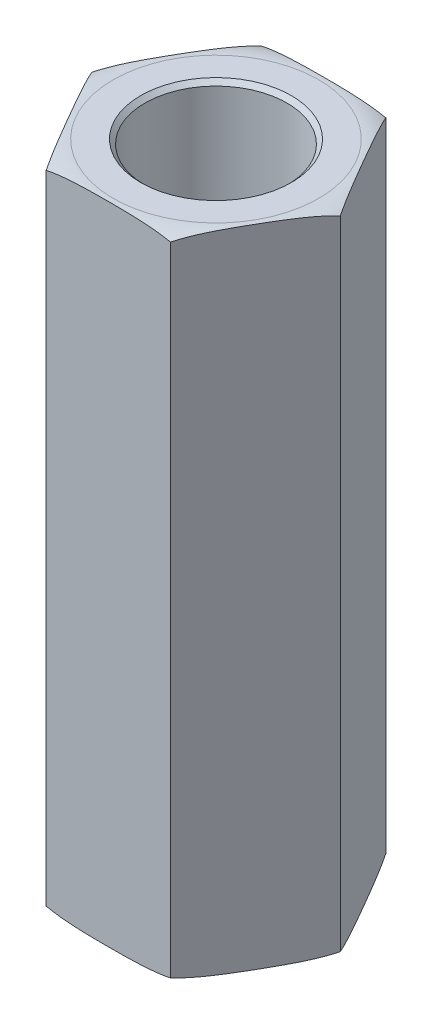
ISO-10303-21;
HEADER;
FILE_DESCRIPTION(('STEP AP214'),'2;1');
FILE_NAME('part.step','',(''),(''),'','','');
FILE_SCHEMA(('AUTOMOTIVE_DESIGN { 1 0 10303 214 1 1 1 1 }'));
ENDSEC;
DATA;
#1=APPLICATION_CONTEXT('core data for automotive mechanical design processes');
#2=APPLICATION_PROTOCOL_DEFINITION('international standard','automotive_design',2000,#1);
#3=PRODUCT_CONTEXT('',#1,'mechanical');
#4=PRODUCT('Part','Part','',(#3));
#5=PRODUCT_RELATED_PRODUCT_CATEGORY('part','',(#4));
#6=PRODUCT_DEFINITION_FORMATION('','',#4);
#7=PRODUCT_DEFINITION_CONTEXT('part definition',#1,'design');
#8=PRODUCT_DEFINITION('design','',#6,#7);
#9=PRODUCT_DEFINITION_SHAPE('','',#8);
#10=(LENGTH_UNIT() NAMED_UNIT(*) SI_UNIT(.MILLI.,.METRE.));
#11=(NAMED_UNIT(*) PLANE_ANGLE_UNIT() SI_UNIT($,.RADIAN.));
#12=(NAMED_UNIT(*) SI_UNIT($,.STERADIAN.) SOLID_ANGLE_UNIT());
#13=UNCERTAINTY_MEASURE_WITH_UNIT(LENGTH_MEASURE(1.E-05),#10,'distance_accuracy_value','');
#14=(GEOMETRIC_REPRESENTATION_CONTEXT(3) GLOBAL_UNCERTAINTY_ASSIGNED_CONTEXT((#13)) GLOBAL_UNIT_ASSIGNED_CONTEXT((#10,
#11,#12)) REPRESENTATION_CONTEXT('',''));
#15=CARTESIAN_POINT('',(0.,0.,0.));
#16=DIRECTION('',(0.,0.,1.));
#17=DIRECTION('',(1.,0.,0.));
#18=AXIS2_PLACEMENT_3D('',#15,#16,#17);
#19=CARTESIAN_POINT('',(3.66617420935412,9.525,0.));
#20=DIRECTION('',(-0.866025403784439,0.,0.5));
#21=DIRECTION('',(0.5,0.,0.866025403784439));
#22=AXIS2_PLACEMENT_3D('',#19,#20,#21);
#23=PLANE('',#22);
#24=CARTESIAN_POINT('',(3.66617420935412,9.398,0.));
#25=CARTESIAN_POINT('',(3.63753042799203,9.40993202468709,-0.0496124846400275));
#26=CARTESIAN_POINT('',(3.60875945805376,9.42055614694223,-0.0994452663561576));
#27=CARTESIAN_POINT('',(3.5510445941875,9.43952869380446,-0.199410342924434));
#28=CARTESIAN_POINT('',(3.52210079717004,9.44787829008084,-0.249542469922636));
#29=CARTESIAN_POINT('',(3.43520914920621,9.47001015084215,-0.400043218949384));
#30=CARTESIAN_POINT('',(3.37708055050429,9.48092253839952,-0.500724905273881));
#31=CARTESIAN_POINT('',(3.26070078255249,9.4975474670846,-0.702300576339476));
#32=CARTESIAN_POINT('',(3.20244972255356,9.50326351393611,-0.803194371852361));
#33=CARTESIAN_POINT('',(3.08586365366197,9.51154325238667,-1.00512736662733));
#34=CARTESIAN_POINT('',(3.02752861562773,9.5141051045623,-1.1061666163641));
#35=CARTESIAN_POINT('',(2.91138213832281,9.5174800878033,-1.30733821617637));
#36=CARTESIAN_POINT('',(2.85357078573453,9.51830898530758,-1.40747041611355));
#37=CARTESIAN_POINT('',(2.73795502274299,9.51890235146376,-1.60772279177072));
#38=CARTESIAN_POINT('',(2.68015061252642,9.51866697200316,-1.70784296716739));
#39=CARTESIAN_POINT('',(2.56452713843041,9.51693398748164,-1.9081086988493));
#40=CARTESIAN_POINT('',(2.50670807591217,9.51543597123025,-2.00825425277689));
#41=CARTESIAN_POINT('',(2.39109525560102,9.51017531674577,-2.20850153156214));
#42=CARTESIAN_POINT('',(2.33330149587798,9.50641290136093,-2.30860325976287));
#43=CARTESIAN_POINT('',(2.23849359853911,9.49698899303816,-2.47281535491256));
#44=CARTESIAN_POINT('',(2.20145192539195,9.49249057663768,-2.5369734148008));
#45=CARTESIAN_POINT('',(2.12747060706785,9.48130148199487,-2.66511281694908));
#46=CARTESIAN_POINT('',(2.09053091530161,9.47461207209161,-2.72909423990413));
#47=CARTESIAN_POINT('',(2.01669860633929,9.45839780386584,-2.85697555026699));
#48=CARTESIAN_POINT('',(1.97980639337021,9.44886525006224,-2.92087473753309));
#49=CARTESIAN_POINT('',(1.90623831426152,9.42626291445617,-3.04829838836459));
#50=CARTESIAN_POINT('',(1.86956287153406,9.41318767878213,-3.11182211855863));
#51=CARTESIAN_POINT('',(1.83308710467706,9.398,-3.175));
#52=B_SPLINE_CURVE_WITH_KNOTS('',3,(#24,#25,#26,#27,#28,#29,#30,#31,#32,#33,#34,#35,#36,#37,#38,
#39,#40,#41,#42,#43,#44,#45,#46,#47,#48,#49,#50,#51),.UNSPECIFIED.,.F.,.F.,(4,2,2,2,2,2,2,2,2,2,
2,2,2,4),(0.,0.17550946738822,0.350928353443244,0.701031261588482,1.05089779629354,
1.40096826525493,1.74783967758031,2.09466158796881,2.44159648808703,2.78849725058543,
3.0111319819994,3.23363806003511,3.45675194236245,3.68021127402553),.UNSPECIFIED.);
#53=CARTESIAN_POINT('',(3.66617420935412,9.398,0.));
#54=VERTEX_POINT('',#53);
#55=CARTESIAN_POINT('',(1.83308710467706,9.398,-3.175));
#56=VERTEX_POINT('',#55);
#57=EDGE_CURVE('E107',#54,#56,#52,.T.);
#58=ORIENTED_EDGE('',*,*,#57,.F.);
#59=DIRECTION('',(0.,1.,0.));
#60=VECTOR('',#59,1.);
#61=CARTESIAN_POINT('',(3.66617420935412,9.525,0.));
#62=LINE('',#61,#60);
#63=CARTESIAN_POINT('',(3.66617420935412,-9.398,0.));
#64=VERTEX_POINT('',#63);
#65=EDGE_CURVE('E80',#54,#64,#62,.F.);
#66=ORIENTED_EDGE('',*,*,#65,.T.);
#67=CARTESIAN_POINT('',(1.83308710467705,-9.398,-3.17500000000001));
#68=CARTESIAN_POINT('',(1.86173088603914,-9.40993202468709,-3.12538751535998));
#69=CARTESIAN_POINT('',(1.89050185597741,-9.42055614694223,-3.07555473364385));
#70=CARTESIAN_POINT('',(1.94821671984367,-9.43952869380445,-2.97558965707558));
#71=CARTESIAN_POINT('',(1.97716051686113,-9.44787829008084,-2.92545753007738));
#72=CARTESIAN_POINT('',(2.06405216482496,-9.47001015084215,-2.77495678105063));
#73=CARTESIAN_POINT('',(2.12218076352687,-9.48092253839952,-2.67427509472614));
#74=CARTESIAN_POINT('',(2.23856053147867,-9.4975474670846,-2.47269942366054));
#75=CARTESIAN_POINT('',(2.2968115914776,-9.50326351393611,-2.37180562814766));
#76=CARTESIAN_POINT('',(2.41339766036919,-9.51154325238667,-2.1698726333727));
#77=CARTESIAN_POINT('',(2.47173269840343,-9.5141051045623,-2.06883338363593));
#78=CARTESIAN_POINT('',(2.58787917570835,-9.5174800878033,-1.86766178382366));
#79=CARTESIAN_POINT('',(2.64569052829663,-9.51830898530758,-1.76752958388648));
#80=CARTESIAN_POINT('',(2.76130629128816,-9.51890235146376,-1.56727720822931));
#81=CARTESIAN_POINT('',(2.81911070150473,-9.51866697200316,-1.46715703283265));
#82=CARTESIAN_POINT('',(2.93473417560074,-9.51693398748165,-1.26689130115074));
#83=CARTESIAN_POINT('',(2.99255323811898,-9.51543597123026,-1.16674574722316));
#84=CARTESIAN_POINT('',(3.10816605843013,-9.51017531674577,-0.966498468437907));
#85=CARTESIAN_POINT('',(3.16595981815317,-9.50641290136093,-0.866396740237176));
#86=CARTESIAN_POINT('',(3.26076771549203,-9.49698899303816,-0.702184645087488));
#87=CARTESIAN_POINT('',(3.2978093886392,-9.49249057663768,-0.63802658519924));
#88=CARTESIAN_POINT('',(3.37179070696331,-9.48130148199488,-0.509887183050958));
#89=CARTESIAN_POINT('',(3.40873039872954,-9.47461207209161,-0.445905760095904));
#90=CARTESIAN_POINT('',(3.48256270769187,-9.45839780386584,-0.318024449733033));
#91=CARTESIAN_POINT('',(3.51945492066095,-9.44886525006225,-0.254125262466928));
#92=CARTESIAN_POINT('',(3.59302299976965,-9.42626291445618,-0.126701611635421));
#93=CARTESIAN_POINT('',(3.62969844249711,-9.41318767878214,-0.0631778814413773));
#94=CARTESIAN_POINT('',(3.66617420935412,-9.398,0.));
#95=B_SPLINE_CURVE_WITH_KNOTS('',3,(#67,#68,#69,#70,#71,#72,#73,#74,#75,#76,#77,#78,#79,#80,#81,
#82,#83,#84,#85,#86,#87,#88,#89,#90,#91,#92,#93,#94),.UNSPECIFIED.,.F.,.F.,(4,2,2,2,2,2,2,2,2,2,
2,2,2,4),(0.,0.175509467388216,0.350928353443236,0.701031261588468,1.05089779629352,
1.4009682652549,1.74783967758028,2.09466158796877,2.44159648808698,2.78849725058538,
3.01113198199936,3.23363806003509,3.45675194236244,3.68021127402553),.UNSPECIFIED.);
#96=CARTESIAN_POINT('',(1.83308710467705,-9.398,-3.175));
#97=VERTEX_POINT('',#96);
#98=EDGE_CURVE('E97',#97,#64,#95,.T.);
#99=ORIENTED_EDGE('',*,*,#98,.F.);
#100=DIRECTION('',(0.,1.,0.));
#101=VECTOR('',#100,1.);
#102=CARTESIAN_POINT('',(1.83308710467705,9.525,-3.175));
#103=LINE('',#102,#101);
#104=EDGE_CURVE('E111',#97,#56,#103,.T.);
#105=ORIENTED_EDGE('',*,*,#104,.T.);
#106=EDGE_LOOP('',(#58,#66,#99,#105));
#107=FACE_BOUND('',#106,.T.);
#108=ADVANCED_FACE('F17',(#107),#23,.F.);
#109=CARTESIAN_POINT('',(1.83308710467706,9.525,3.17499999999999));
#110=DIRECTION('',(-0.866025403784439,0.,-0.5));
#111=DIRECTION('',(-0.5,0.,0.866025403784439));
#112=AXIS2_PLACEMENT_3D('',#109,#110,#111);
#113=PLANE('',#112);
#114=CARTESIAN_POINT('',(1.83308710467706,9.398,3.17499999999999));
#115=CARTESIAN_POINT('',(1.86173088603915,9.40993202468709,3.12538751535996));
#116=CARTESIAN_POINT('',(1.89050185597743,9.42055614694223,3.07555473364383));
#117=CARTESIAN_POINT('',(1.94821671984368,9.43952869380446,2.97558965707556));
#118=CARTESIAN_POINT('',(1.97716051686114,9.44787829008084,2.92545753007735));
#119=CARTESIAN_POINT('',(2.06405216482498,9.47001015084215,2.77495678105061));
#120=CARTESIAN_POINT('',(2.12218076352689,9.48092253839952,2.67427509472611));
#121=CARTESIAN_POINT('',(2.23856053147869,9.4975474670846,2.47269942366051));
#122=CARTESIAN_POINT('',(2.29681159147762,9.50326351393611,2.37180562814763));
#123=CARTESIAN_POINT('',(2.41339766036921,9.51154325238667,2.16987263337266));
#124=CARTESIAN_POINT('',(2.47173269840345,9.5141051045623,2.06883338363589));
#125=CARTESIAN_POINT('',(2.58787917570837,9.5174800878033,1.86766178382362));
#126=CARTESIAN_POINT('',(2.64569052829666,9.51830898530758,1.76752958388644));
#127=CARTESIAN_POINT('',(2.76130629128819,9.51890235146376,1.56727720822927));
#128=CARTESIAN_POINT('',(2.81911070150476,9.51866697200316,1.4671570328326));
#129=CARTESIAN_POINT('',(2.93473417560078,9.51693398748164,1.26689130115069));
#130=CARTESIAN_POINT('',(2.99255323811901,9.51543597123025,1.1667457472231));
#131=CARTESIAN_POINT('',(3.10816605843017,9.51017531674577,0.966498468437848));
#132=CARTESIAN_POINT('',(3.16595981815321,9.50641290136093,0.866396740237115));
#133=CARTESIAN_POINT('',(3.26076771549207,9.49698899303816,0.702184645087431));
#134=CARTESIAN_POINT('',(3.29780938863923,9.49249057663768,0.638026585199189));
#135=CARTESIAN_POINT('',(3.37179070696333,9.48130148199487,0.509887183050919));
#136=CARTESIAN_POINT('',(3.40873039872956,9.47461207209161,0.44590576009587));
#137=CARTESIAN_POINT('',(3.48256270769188,9.45839780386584,0.31802444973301));
#138=CARTESIAN_POINT('',(3.51945492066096,9.44886525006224,0.254125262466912));
#139=CARTESIAN_POINT('',(3.59302299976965,9.42626291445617,0.126701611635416));
#140=CARTESIAN_POINT('',(3.62969844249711,9.41318767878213,0.0631778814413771));
#141=CARTESIAN_POINT('',(3.66617420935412,9.398,0.));
#142=B_SPLINE_CURVE_WITH_KNOTS('',3,(#114,#115,#116,#117,#118,#119,#120,#121,#122,#123,#124,
#125,#126,#127,#128,#129,#130,#131,#132,#133,#134,#135,#136,#137,#138,#139,#140,#141),
.UNSPECIFIED.,.F.,.F.,(4,2,2,2,2,2,2,2,2,2,2,2,2,4),(0.,0.17550946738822,0.350928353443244,
0.701031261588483,1.05089779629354,1.40096826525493,1.74783967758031,2.09466158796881,
2.44159648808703,2.78849725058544,3.01113198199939,3.2336380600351,3.45675194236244,
3.68021127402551),.UNSPECIFIED.);
#143=CARTESIAN_POINT('',(1.83308710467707,9.398,3.17499999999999));
#144=VERTEX_POINT('',#143);
#145=EDGE_CURVE('E22',#144,#54,#142,.T.);
#146=ORIENTED_EDGE('',*,*,#145,.F.);
#147=DIRECTION('',(0.,1.,0.));
#148=VECTOR('',#147,1.);
#149=CARTESIAN_POINT('',(1.83308710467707,9.525,3.17499999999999));
#150=LINE('',#149,#148);
#151=CARTESIAN_POINT('',(1.83308710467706,-9.398,3.17499999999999));
#152=VERTEX_POINT('',#151);
#153=EDGE_CURVE('E100',#144,#152,#150,.F.);
#154=ORIENTED_EDGE('',*,*,#153,.T.);
#155=CARTESIAN_POINT('',(3.66617420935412,-9.398,0.));
#156=CARTESIAN_POINT('',(3.63753042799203,-9.40993202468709,0.0496124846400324));
#157=CARTESIAN_POINT('',(3.60875945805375,-9.42055614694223,0.0994452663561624));
#158=CARTESIAN_POINT('',(3.5510445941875,-9.43952869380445,0.199410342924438));
#159=CARTESIAN_POINT('',(3.52210079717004,-9.44787829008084,0.24954246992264));
#160=CARTESIAN_POINT('',(3.43520914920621,-9.47001015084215,0.400043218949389));
#161=CARTESIAN_POINT('',(3.37708055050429,-9.48092253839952,0.500724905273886));
#162=CARTESIAN_POINT('',(3.26070078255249,-9.4975474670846,0.702300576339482));
#163=CARTESIAN_POINT('',(3.20244972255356,-9.50326351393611,0.803194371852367));
#164=CARTESIAN_POINT('',(3.08586365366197,-9.51154325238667,1.00512736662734));
#165=CARTESIAN_POINT('',(3.02752861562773,-9.5141051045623,1.1061666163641));
#166=CARTESIAN_POINT('',(2.91138213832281,-9.5174800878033,1.30733821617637));
#167=CARTESIAN_POINT('',(2.85357078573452,-9.51830898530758,1.40747041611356));
#168=CARTESIAN_POINT('',(2.73795502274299,-9.51890235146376,1.60772279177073));
#169=CARTESIAN_POINT('',(2.68015061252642,-9.51866697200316,1.70784296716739));
#170=CARTESIAN_POINT('',(2.5645271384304,-9.51693398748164,1.90810869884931));
#171=CARTESIAN_POINT('',(2.50670807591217,-9.51543597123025,2.00825425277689));
#172=CARTESIAN_POINT('',(2.39109525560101,-9.51017531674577,2.20850153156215));
#173=CARTESIAN_POINT('',(2.33330149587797,-9.50641290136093,2.30860325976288));
#174=CARTESIAN_POINT('',(2.23849359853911,-9.49698899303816,2.47281535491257));
#175=CARTESIAN_POINT('',(2.20145192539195,-9.49249057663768,2.53697341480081));
#176=CARTESIAN_POINT('',(2.12747060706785,-9.48130148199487,2.66511281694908));
#177=CARTESIAN_POINT('',(2.09053091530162,-9.47461207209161,2.72909423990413));
#178=CARTESIAN_POINT('',(2.0166986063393,-9.45839780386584,2.85697555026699));
#179=CARTESIAN_POINT('',(1.97980639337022,-9.44886525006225,2.92087473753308));
#180=CARTESIAN_POINT('',(1.90623831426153,-9.42626291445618,3.04829838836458));
#181=CARTESIAN_POINT('',(1.86956287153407,-9.41318767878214,3.11182211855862));
#182=CARTESIAN_POINT('',(1.83308710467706,-9.398,3.17499999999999));
#183=B_SPLINE_CURVE_WITH_KNOTS('',3,(#155,#156,#157,#158,#159,#160,#161,#162,#163,#164,#165,
#166,#167,#168,#169,#170,#171,#172,#173,#174,#175,#176,#177,#178,#179,#180,#181,#182),
.UNSPECIFIED.,.F.,.F.,(4,2,2,2,2,2,2,2,2,2,2,2,2,4),(0.,0.175509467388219,0.350928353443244,
0.701031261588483,1.05089779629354,1.40096826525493,1.74783967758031,2.09466158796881,
2.44159648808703,2.78849725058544,3.01113198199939,3.2336380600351,3.45675194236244,
3.68021127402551),.UNSPECIFIED.);
#184=EDGE_CURVE('E205',#64,#152,#183,.T.);
#185=ORIENTED_EDGE('',*,*,#184,.F.);
#186=ORIENTED_EDGE('',*,*,#65,.F.);
#187=EDGE_LOOP('',(#146,#154,#185,#186));
#188=FACE_BOUND('',#187,.T.);
#189=ADVANCED_FACE('F106',(#188),#113,.F.);
#190=CARTESIAN_POINT('',(-1.83308710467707,9.525,3.175));
#191=DIRECTION('',(0.,0.,-1.));
#192=DIRECTION('',(-1.,0.,0.));
#193=AXIS2_PLACEMENT_3D('',#190,#191,#192);
#194=PLANE('',#193);
#195=ORIENTED_EDGE('',*,*,#153,.F.);
#196=CARTESIAN_POINT('',(-1.83308710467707,9.39799999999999,3.175));
#197=CARTESIAN_POINT('',(-1.75760871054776,9.41371230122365,3.175));
#198=CARTESIAN_POINT('',(-1.68170571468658,9.4271647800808,3.175));
#199=CARTESIAN_POINT('',(-1.52939807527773,9.45030486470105,3.175));
#200=CARTESIAN_POINT('',(-1.45299400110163,9.45999617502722,3.175));
#201=CARTESIAN_POINT('',(-1.30011823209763,9.47637135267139,3.175));
#202=CARTESIAN_POINT('',(-1.22364747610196,9.48306442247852,3.175));
#203=CARTESIAN_POINT('',(-1.07052459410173,9.49417241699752,3.175));
#204=CARTESIAN_POINT('',(-0.993872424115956,9.49858671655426,3.175));
#205=CARTESIAN_POINT('',(-0.840856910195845,9.50572419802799,3.175));
#206=CARTESIAN_POINT('',(-0.764493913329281,9.50845527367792,3.175));
#207=CARTESIAN_POINT('',(-0.611734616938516,9.51275632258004,3.175));
#208=CARTESIAN_POINT('',(-0.535338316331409,9.51432625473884,3.175));
#209=CARTESIAN_POINT('',(-0.38245423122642,9.51668247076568,3.175));
#210=CARTESIAN_POINT('',(-0.305966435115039,9.51746792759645,3.175));
#211=CARTESIAN_POINT('',(-0.152985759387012,9.51848841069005,3.175));
#212=CARTESIAN_POINT('',(-0.076492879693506,9.51872342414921,3.175));
#213=CARTESIAN_POINT('',(0.0764928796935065,9.51872342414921,3.175));
#214=CARTESIAN_POINT('',(0.152985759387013,9.51848841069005,3.17499999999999));
#215=CARTESIAN_POINT('',(0.305966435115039,9.51746792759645,3.17499999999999));
#216=CARTESIAN_POINT('',(0.38245423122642,9.51668247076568,3.17499999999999));
#217=CARTESIAN_POINT('',(0.535338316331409,9.51432625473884,3.17499999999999));
#218=CARTESIAN_POINT('',(0.611734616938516,9.51275632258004,3.17499999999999));
#219=CARTESIAN_POINT('',(0.764493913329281,9.50845527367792,3.17499999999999));
#220=CARTESIAN_POINT('',(0.840856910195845,9.50572419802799,3.17499999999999));
#221=CARTESIAN_POINT('',(0.993872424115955,9.49858671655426,3.17499999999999));
#222=CARTESIAN_POINT('',(1.07052459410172,9.49417241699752,3.17499999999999));
#223=CARTESIAN_POINT('',(1.22364747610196,9.48306442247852,3.17499999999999));
#224=CARTESIAN_POINT('',(1.30011823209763,9.47637135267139,3.17499999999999));
#225=CARTESIAN_POINT('',(1.45299400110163,9.45999617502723,3.17499999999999));
#226=CARTESIAN_POINT('',(1.52939807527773,9.45030486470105,3.17499999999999));
#227=CARTESIAN_POINT('',(1.68170571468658,9.42716478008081,3.17499999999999));
#228=CARTESIAN_POINT('',(1.75760871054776,9.41371230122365,3.17499999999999));
#229=CARTESIAN_POINT('',(1.83308710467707,9.398,3.17499999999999));
#230=B_SPLINE_CURVE_WITH_KNOTS('',3,(#196,#197,#198,#199,#200,#201,#202,#203,#204,#205,#206,
#207,#208,#209,#210,#211,#212,#213,#214,#215,#216,#217,#218,#219,#220,#221,#222,#223,#224,#225,
#226,#227,#228,#229),.UNSPECIFIED.,.F.,.F.,(4,2,2,2,2,2,2,2,2,2,2,2,2,2,2,2,4),(0.,
0.23119079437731,0.46215329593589,0.692401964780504,0.922713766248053,1.15193709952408,
1.3811685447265,1.61064140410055,1.84011960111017,2.06959779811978,2.29907065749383,
2.52830210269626,2.75752543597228,2.98783723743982,3.21808590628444,3.44904840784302,
3.68023920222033),.UNSPECIFIED.);
#231=CARTESIAN_POINT('',(-1.83308710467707,9.398,3.175));
#232=VERTEX_POINT('',#231);
#233=EDGE_CURVE('E86',#232,#144,#230,.T.);
#234=ORIENTED_EDGE('',*,*,#233,.F.);
#235=DIRECTION('',(0.,1.,0.));
#236=VECTOR('',#235,1.);
#237=CARTESIAN_POINT('',(-1.83308710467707,9.525,3.175));
#238=LINE('',#237,#236);
#239=CARTESIAN_POINT('',(-1.83308710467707,-9.398,3.175));
#240=VERTEX_POINT('',#239);
#241=EDGE_CURVE('E104',#232,#240,#238,.F.);
#242=ORIENTED_EDGE('',*,*,#241,.T.);
#243=CARTESIAN_POINT('',(1.83308710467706,-9.398,3.17499999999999));
#244=CARTESIAN_POINT('',(1.75760871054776,-9.41371230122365,3.17499999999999));
#245=CARTESIAN_POINT('',(1.68170571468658,-9.42716478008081,3.17499999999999));
#246=CARTESIAN_POINT('',(1.52939807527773,-9.45030486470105,3.17499999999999));
#247=CARTESIAN_POINT('',(1.45299400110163,-9.45999617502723,3.17499999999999));
#248=CARTESIAN_POINT('',(1.30011823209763,-9.47637135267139,3.17499999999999));
#249=CARTESIAN_POINT('',(1.22364747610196,-9.48306442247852,3.17499999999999));
#250=CARTESIAN_POINT('',(1.07052459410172,-9.49417241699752,3.17499999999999));
#251=CARTESIAN_POINT('',(0.993872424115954,-9.49858671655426,3.17499999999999));
#252=CARTESIAN_POINT('',(0.840856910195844,-9.50572419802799,3.17499999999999));
#253=CARTESIAN_POINT('',(0.76449391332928,-9.50845527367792,3.17499999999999));
#254=CARTESIAN_POINT('',(0.611734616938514,-9.51275632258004,3.17499999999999));
#255=CARTESIAN_POINT('',(0.535338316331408,-9.51432625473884,3.17499999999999));
#256=CARTESIAN_POINT('',(0.382454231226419,-9.51668247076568,3.17499999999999));
#257=CARTESIAN_POINT('',(0.305966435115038,-9.51746792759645,3.17499999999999));
#258=CARTESIAN_POINT('',(0.152985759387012,-9.51848841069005,3.17499999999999));
#259=CARTESIAN_POINT('',(0.076492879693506,-9.51872342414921,3.175));
#260=CARTESIAN_POINT('',(-0.0764928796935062,-9.51872342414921,3.175));
#261=CARTESIAN_POINT('',(-0.152985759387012,-9.51848841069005,3.175));
#262=CARTESIAN_POINT('',(-0.305966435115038,-9.51746792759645,3.175));
#263=CARTESIAN_POINT('',(-0.382454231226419,-9.51668247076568,3.175));
#264=CARTESIAN_POINT('',(-0.535338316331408,-9.51432625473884,3.175));
#265=CARTESIAN_POINT('',(-0.611734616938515,-9.51275632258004,3.175));
#266=CARTESIAN_POINT('',(-0.76449391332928,-9.50845527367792,3.175));
#267=CARTESIAN_POINT('',(-0.840856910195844,-9.50572419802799,3.175));
#268=CARTESIAN_POINT('',(-0.993872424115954,-9.49858671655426,3.175));
#269=CARTESIAN_POINT('',(-1.07052459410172,-9.49417241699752,3.175));
#270=CARTESIAN_POINT('',(-1.22364747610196,-9.48306442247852,3.175));
#271=CARTESIAN_POINT('',(-1.30011823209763,-9.47637135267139,3.175));
#272=CARTESIAN_POINT('',(-1.45299400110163,-9.45999617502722,3.175));
#273=CARTESIAN_POINT('',(-1.52939807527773,-9.45030486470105,3.175));
#274=CARTESIAN_POINT('',(-1.68170571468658,-9.4271647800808,3.175));
#275=CARTESIAN_POINT('',(-1.75760871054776,-9.41371230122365,3.175));
#276=CARTESIAN_POINT('',(-1.83308710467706,-9.398,3.175));
#277=B_SPLINE_CURVE_WITH_KNOTS('',3,(#243,#244,#245,#246,#247,#248,#249,#250,#251,#252,#253,
#254,#255,#256,#257,#258,#259,#260,#261,#262,#263,#264,#265,#266,#267,#268,#269,#270,#271,#272,
#273,#274,#275,#276),.UNSPECIFIED.,.F.,.F.,(4,2,2,2,2,2,2,2,2,2,2,2,2,2,2,2,4),(0.,
0.23119079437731,0.462153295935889,0.692401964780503,0.922713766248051,1.15193709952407,
1.3811685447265,1.61064140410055,1.84011960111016,2.06959779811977,2.29907065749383,
2.52830210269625,2.75752543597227,2.98783723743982,3.21808590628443,3.44904840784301,
3.68023920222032),.UNSPECIFIED.);
#278=EDGE_CURVE('E102',#152,#240,#277,.T.);
#279=ORIENTED_EDGE('',*,*,#278,.F.);
#280=EDGE_LOOP('',(#195,#234,#242,#279));
#281=FACE_BOUND('',#280,.T.);
#282=ADVANCED_FACE('F101',(#281),#194,.F.);
#283=CARTESIAN_POINT('',(-3.66617420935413,9.525,0.));
#284=DIRECTION('',(0.866025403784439,0.,-0.499999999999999));
#285=DIRECTION('',(-0.499999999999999,0.,-0.866025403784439));
#286=AXIS2_PLACEMENT_3D('',#283,#284,#285);
#287=PLANE('',#286);
#288=CARTESIAN_POINT('',(-3.66617420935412,9.39799999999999,0.));
#289=CARTESIAN_POINT('',(-3.63753042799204,9.40993202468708,0.0496124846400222));
#290=CARTESIAN_POINT('',(-3.60875945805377,9.42055614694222,0.0994452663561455));
#291=CARTESIAN_POINT('',(-3.55104459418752,9.43952869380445,0.199410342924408));
#292=CARTESIAN_POINT('',(-3.52210079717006,9.44787829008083,0.249542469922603));
#293=CARTESIAN_POINT('',(-3.43520914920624,9.47001015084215,0.400043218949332));
#294=CARTESIAN_POINT('',(-3.37708055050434,9.48092253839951,0.500724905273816));
#295=CARTESIAN_POINT('',(-3.26070078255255,9.4975474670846,0.702300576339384));
#296=CARTESIAN_POINT('',(-3.20244972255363,9.50326351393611,0.803194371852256));
#297=CARTESIAN_POINT('',(-3.08586365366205,9.51154325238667,1.0051273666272));
#298=CARTESIAN_POINT('',(-3.02752861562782,9.5141051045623,1.10616661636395));
#299=CARTESIAN_POINT('',(-2.91138213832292,9.5174800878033,1.30733821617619));
#300=CARTESIAN_POINT('',(-2.85357078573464,9.51830898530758,1.40747041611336));
#301=CARTESIAN_POINT('',(-2.73795502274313,9.51890235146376,1.60772279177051));
#302=CARTESIAN_POINT('',(-2.68015061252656,9.51866697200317,1.70784296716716));
#303=CARTESIAN_POINT('',(-2.56452713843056,9.51693398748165,1.90810869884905));
#304=CARTESIAN_POINT('',(-2.50670807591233,9.51543597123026,2.00825425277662));
#305=CARTESIAN_POINT('',(-2.39109525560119,9.51017531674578,2.20850153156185));
#306=CARTESIAN_POINT('',(-2.33330149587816,9.50641290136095,2.30860325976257));
#307=CARTESIAN_POINT('',(-2.23849359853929,9.49698899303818,2.47281535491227));
#308=CARTESIAN_POINT('',(-2.20145192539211,9.4924905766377,2.53697341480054));
#309=CARTESIAN_POINT('',(-2.12747060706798,9.48130148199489,2.66511281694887));
#310=CARTESIAN_POINT('',(-2.09053091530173,9.47461207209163,2.72909423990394));
#311=CARTESIAN_POINT('',(-2.01669860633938,9.45839780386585,2.85697555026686));
#312=CARTESIAN_POINT('',(-1.97980639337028,9.44886525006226,2.92087473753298));
#313=CARTESIAN_POINT('',(-1.90623831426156,9.42626291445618,3.04829838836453));
#314=CARTESIAN_POINT('',(-1.86956287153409,9.41318767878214,3.1118221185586));
#315=CARTESIAN_POINT('',(-1.83308710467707,9.39799999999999,3.175));
#316=B_SPLINE_CURVE_WITH_KNOTS('',3,(#288,#289,#290,#291,#292,#293,#294,#295,#296,#297,#298,
#299,#300,#301,#302,#303,#304,#305,#306,#307,#308,#309,#310,#311,#312,#313,#314,#315),
.UNSPECIFIED.,.F.,.F.,(4,2,2,2,2,2,2,2,2,2,2,2,2,4),(0.,0.175509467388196,0.350928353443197,
0.70103126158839,1.0508977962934,1.40096826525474,1.74783967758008,2.09466158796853,
2.4415964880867,2.78849725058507,3.01113198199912,3.23363806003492,3.45675194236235,
3.68021127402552),.UNSPECIFIED.);
#317=CARTESIAN_POINT('',(-3.66617420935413,9.39799999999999,0.));
#318=VERTEX_POINT('',#317);
#319=EDGE_CURVE('E94',#318,#232,#316,.T.);
#320=ORIENTED_EDGE('',*,*,#319,.F.);
#321=DIRECTION('',(0.,1.,0.));
#322=VECTOR('',#321,1.);
#323=CARTESIAN_POINT('',(-3.66617420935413,9.525,0.));
#324=LINE('',#323,#322);
#325=CARTESIAN_POINT('',(-3.66617420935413,-9.398,0.));
#326=VERTEX_POINT('',#325);
#327=EDGE_CURVE('E118',#318,#326,#324,.F.);
#328=ORIENTED_EDGE('',*,*,#327,.T.);
#329=CARTESIAN_POINT('',(-1.83308710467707,-9.39799999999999,3.175));
#330=CARTESIAN_POINT('',(-1.86173088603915,-9.40993202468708,3.12538751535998));
#331=CARTESIAN_POINT('',(-1.89050185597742,-9.42055614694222,3.07555473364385));
#332=CARTESIAN_POINT('',(-1.94821671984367,-9.43952869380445,2.97558965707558));
#333=CARTESIAN_POINT('',(-1.97716051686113,-9.44787829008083,2.92545753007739));
#334=CARTESIAN_POINT('',(-2.06405216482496,-9.47001015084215,2.77495678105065));
#335=CARTESIAN_POINT('',(-2.12218076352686,-9.48092253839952,2.67427509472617));
#336=CARTESIAN_POINT('',(-2.23856053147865,-9.4975474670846,2.47269942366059));
#337=CARTESIAN_POINT('',(-2.29681159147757,-9.50326351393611,2.37180562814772));
#338=CARTESIAN_POINT('',(-2.41339766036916,-9.51154325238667,2.16987263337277));
#339=CARTESIAN_POINT('',(-2.47173269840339,-9.5141051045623,2.06883338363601));
#340=CARTESIAN_POINT('',(-2.5878791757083,-9.5174800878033,1.86766178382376));
#341=CARTESIAN_POINT('',(-2.64569052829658,-9.51830898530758,1.76752958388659));
#342=CARTESIAN_POINT('',(-2.7613062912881,-9.51890235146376,1.56727720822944));
#343=CARTESIAN_POINT('',(-2.81911070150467,-9.51866697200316,1.46715703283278));
#344=CARTESIAN_POINT('',(-2.93473417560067,-9.51693398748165,1.26689130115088));
#345=CARTESIAN_POINT('',(-2.9925532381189,-9.51543597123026,1.16674574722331));
#346=CARTESIAN_POINT('',(-3.10816605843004,-9.51017531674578,0.966498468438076));
#347=CARTESIAN_POINT('',(-3.16595981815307,-9.50641290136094,0.866396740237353));
#348=CARTESIAN_POINT('',(-3.26076771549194,-9.49698899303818,0.702184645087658));
#349=CARTESIAN_POINT('',(-3.29780938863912,-9.49249057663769,0.638026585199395));
#350=CARTESIAN_POINT('',(-3.37179070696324,-9.48130148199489,0.509887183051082));
#351=CARTESIAN_POINT('',(-3.40873039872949,-9.47461207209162,0.445905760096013));
#352=CARTESIAN_POINT('',(-3.48256270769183,-9.45839780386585,0.318024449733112));
#353=CARTESIAN_POINT('',(-3.51945492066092,-9.44886525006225,0.254125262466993));
#354=CARTESIAN_POINT('',(-3.59302299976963,-9.42626291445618,0.126701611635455));
#355=CARTESIAN_POINT('',(-3.6296984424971,-9.41318767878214,0.0631778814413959));
#356=CARTESIAN_POINT('',(-3.66617420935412,-9.398,0.));
#357=B_SPLINE_CURVE_WITH_KNOTS('',3,(#329,#330,#331,#332,#333,#334,#335,#336,#337,#338,#339,
#340,#341,#342,#343,#344,#345,#346,#347,#348,#349,#350,#351,#352,#353,#354,#355,#356),
.UNSPECIFIED.,.F.,.F.,(4,2,2,2,2,2,2,2,2,2,2,2,2,4),(0.,0.175509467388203,0.350928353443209,
0.701031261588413,1.05089779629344,1.40096826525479,1.74783967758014,2.0946615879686,
2.44159648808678,2.78849725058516,3.01113198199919,3.23363806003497,3.45675194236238,
3.68021127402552),.UNSPECIFIED.);
#358=EDGE_CURVE('E196',#240,#326,#357,.T.);
#359=ORIENTED_EDGE('',*,*,#358,.F.);
#360=ORIENTED_EDGE('',*,*,#241,.F.);
#361=EDGE_LOOP('',(#320,#328,#359,#360));
#362=FACE_BOUND('',#361,.T.);
#363=ADVANCED_FACE('F190',(#362),#287,.F.);
#364=CARTESIAN_POINT('',(-1.83308710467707,9.525,-3.175));
#365=DIRECTION('',(0.866025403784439,0.,0.5));
#366=DIRECTION('',(0.5,0.,-0.866025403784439));
#367=AXIS2_PLACEMENT_3D('',#364,#365,#366);
#368=PLANE('',#367);
#369=CARTESIAN_POINT('',(-1.83308710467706,9.39799999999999,-3.17500000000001));
#370=CARTESIAN_POINT('',(-1.86173088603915,9.40993202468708,-3.12538751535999));
#371=CARTESIAN_POINT('',(-1.89050185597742,9.42055614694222,-3.07555473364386));
#372=CARTESIAN_POINT('',(-1.94821671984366,9.43952869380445,-2.9755896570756));
#373=CARTESIAN_POINT('',(-1.97716051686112,9.44787829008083,-2.92545753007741));
#374=CARTESIAN_POINT('',(-2.06405216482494,9.47001015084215,-2.77495678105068));
#375=CARTESIAN_POINT('',(-2.12218076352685,9.48092253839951,-2.6742750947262));
#376=CARTESIAN_POINT('',(-2.23856053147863,9.4975474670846,-2.47269942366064));
#377=CARTESIAN_POINT('',(-2.29681159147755,9.50326351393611,-2.37180562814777));
#378=CARTESIAN_POINT('',(-2.41339766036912,9.51154325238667,-2.16987263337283));
#379=CARTESIAN_POINT('',(-2.47173269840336,9.5141051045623,-2.06883338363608));
#380=CARTESIAN_POINT('',(-2.58787917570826,9.5174800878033,-1.86766178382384));
#381=CARTESIAN_POINT('',(-2.64569052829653,9.51830898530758,-1.76752958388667));
#382=CARTESIAN_POINT('',(-2.76130629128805,9.51890235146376,-1.56727720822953));
#383=CARTESIAN_POINT('',(-2.81911070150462,9.51866697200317,-1.46715703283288));
#384=CARTESIAN_POINT('',(-2.93473417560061,9.51693398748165,-1.26689130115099));
#385=CARTESIAN_POINT('',(-2.99255323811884,9.51543597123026,-1.16674574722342));
#386=CARTESIAN_POINT('',(-3.10816605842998,9.51017531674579,-0.966498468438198));
#387=CARTESIAN_POINT('',(-3.16595981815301,9.50641290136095,-0.86639674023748));
#388=CARTESIAN_POINT('',(-3.26076771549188,9.49698899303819,-0.702184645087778));
#389=CARTESIAN_POINT('',(-3.29780938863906,9.4924905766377,-0.638026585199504));
#390=CARTESIAN_POINT('',(-3.3717907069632,9.4813014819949,-0.50988718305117));
#391=CARTESIAN_POINT('',(-3.40873039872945,9.47461207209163,-0.44590576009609));
#392=CARTESIAN_POINT('',(-3.4825627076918,9.45839780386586,-0.318024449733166));
#393=CARTESIAN_POINT('',(-3.5194549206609,9.44886525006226,-0.254125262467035));
#394=CARTESIAN_POINT('',(-3.59302299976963,9.42626291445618,-0.126701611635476));
#395=CARTESIAN_POINT('',(-3.6296984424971,9.41318767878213,-0.0631778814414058));
#396=CARTESIAN_POINT('',(-3.66617420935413,9.39799999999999,0.));
#397=B_SPLINE_CURVE_WITH_KNOTS('',3,(#369,#370,#371,#372,#373,#374,#375,#376,#377,#378,#379,
#380,#381,#382,#383,#384,#385,#386,#387,#388,#389,#390,#391,#392,#393,#394,#395,#396),
.UNSPECIFIED.,.F.,.F.,(4,2,2,2,2,2,2,2,2,2,2,2,2,4),(0.,0.175509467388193,0.350928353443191,
0.701031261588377,1.05089779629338,1.40096826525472,1.74783967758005,2.0946615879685,
2.44159648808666,2.78849725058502,3.01113198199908,3.2336380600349,3.45675194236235,
3.68021127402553),.UNSPECIFIED.);
#398=CARTESIAN_POINT('',(-1.83308710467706,9.398,-3.175));
#399=VERTEX_POINT('',#398);
#400=EDGE_CURVE('E166',#399,#318,#397,.T.);
#401=ORIENTED_EDGE('',*,*,#400,.F.);
#402=DIRECTION('',(0.,1.,0.));
#403=VECTOR('',#402,1.);
#404=CARTESIAN_POINT('',(-1.83308710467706,9.525,-3.175));
#405=LINE('',#404,#403);
#406=CARTESIAN_POINT('',(-1.83308710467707,-9.39799999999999,-3.175));
#407=VERTEX_POINT('',#406);
#408=EDGE_CURVE('E108',#399,#407,#405,.F.);
#409=ORIENTED_EDGE('',*,*,#408,.T.);
#410=CARTESIAN_POINT('',(-3.66617420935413,-9.39799999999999,0.));
#411=CARTESIAN_POINT('',(-3.63753042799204,-9.40993202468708,-0.0496124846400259));
#412=CARTESIAN_POINT('',(-3.60875945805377,-9.42055614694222,-0.0994452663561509));
#413=CARTESIAN_POINT('',(-3.55104459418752,-9.43952869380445,-0.199410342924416));
#414=CARTESIAN_POINT('',(-3.52210079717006,-9.44787829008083,-0.249542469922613));
#415=CARTESIAN_POINT('',(-3.43520914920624,-9.47001015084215,-0.400043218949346));
#416=CARTESIAN_POINT('',(-3.37708055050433,-9.48092253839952,-0.500724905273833));
#417=CARTESIAN_POINT('',(-3.26070078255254,-9.4975474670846,-0.702300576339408));
#418=CARTESIAN_POINT('',(-3.20244972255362,-9.50326351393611,-0.803194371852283));
#419=CARTESIAN_POINT('',(-3.08586365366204,-9.51154325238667,-1.00512736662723));
#420=CARTESIAN_POINT('',(-3.0275286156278,-9.5141051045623,-1.10616661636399));
#421=CARTESIAN_POINT('',(-2.91138213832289,-9.5174800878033,-1.30733821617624));
#422=CARTESIAN_POINT('',(-2.85357078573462,-9.51830898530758,-1.40747041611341));
#423=CARTESIAN_POINT('',(-2.7379550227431,-9.51890235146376,-1.60772279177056));
#424=CARTESIAN_POINT('',(-2.68015061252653,-9.51866697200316,-1.70784296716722));
#425=CARTESIAN_POINT('',(-2.56452713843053,-9.51693398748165,-1.90810869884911));
#426=CARTESIAN_POINT('',(-2.5067080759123,-9.51543597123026,-2.00825425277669));
#427=CARTESIAN_POINT('',(-2.39109525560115,-9.51017531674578,-2.20850153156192));
#428=CARTESIAN_POINT('',(-2.33330149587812,-9.50641290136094,-2.30860325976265));
#429=CARTESIAN_POINT('',(-2.23849359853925,-9.49698899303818,-2.47281535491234));
#430=CARTESIAN_POINT('',(-2.20145192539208,-9.49249057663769,-2.53697341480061));
#431=CARTESIAN_POINT('',(-2.12747060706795,-9.48130148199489,-2.66511281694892));
#432=CARTESIAN_POINT('',(-2.09053091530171,-9.47461207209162,-2.72909423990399));
#433=CARTESIAN_POINT('',(-2.01669860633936,-9.45839780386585,-2.85697555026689));
#434=CARTESIAN_POINT('',(-1.97980639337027,-9.44886525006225,-2.92087473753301));
#435=CARTESIAN_POINT('',(-1.90623831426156,-9.42626291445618,-3.04829838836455));
#436=CARTESIAN_POINT('',(-1.86956287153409,-9.41318767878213,-3.11182211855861));
#437=CARTESIAN_POINT('',(-1.83308710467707,-9.39799999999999,-3.175));
#438=B_SPLINE_CURVE_WITH_KNOTS('',3,(#410,#411,#412,#413,#414,#415,#416,#417,#418,#419,#420,
#421,#422,#423,#424,#425,#426,#427,#428,#429,#430,#431,#432,#433,#434,#435,#436,#437),
.UNSPECIFIED.,.F.,.F.,(4,2,2,2,2,2,2,2,2,2,2,2,2,4),(0.,0.175509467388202,0.350928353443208,
0.701031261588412,1.05089779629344,1.40096826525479,1.74783967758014,2.0946615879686,
2.44159648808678,2.78849725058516,3.01113198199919,3.23363806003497,3.45675194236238,
3.68021127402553),.UNSPECIFIED.);
#439=EDGE_CURVE('E142',#326,#407,#438,.T.);
#440=ORIENTED_EDGE('',*,*,#439,.F.);
#441=ORIENTED_EDGE('',*,*,#327,.F.);
#442=EDGE_LOOP('',(#401,#409,#440,#441));
#443=FACE_BOUND('',#442,.T.);
#444=ADVANCED_FACE('F152',(#443),#368,.F.);
#445=CARTESIAN_POINT('',(1.83308710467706,9.525,-3.175));
#446=DIRECTION('',(0.,0.,1.));
#447=DIRECTION('',(1.,0.,0.));
#448=AXIS2_PLACEMENT_3D('',#445,#446,#447);
#449=PLANE('',#448);
#450=CARTESIAN_POINT('',(1.83308710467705,9.398,-3.175));
#451=CARTESIAN_POINT('',(1.75760871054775,9.41371230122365,-3.175));
#452=CARTESIAN_POINT('',(1.68170571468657,9.4271647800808,-3.175));
#453=CARTESIAN_POINT('',(1.52939807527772,9.45030486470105,-3.175));
#454=CARTESIAN_POINT('',(1.45299400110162,9.45999617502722,-3.175));
#455=CARTESIAN_POINT('',(1.30011823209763,9.47637135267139,-3.175));
#456=CARTESIAN_POINT('',(1.22364747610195,9.48306442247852,-3.175));
#457=CARTESIAN_POINT('',(1.07052459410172,9.49417241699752,-3.175));
#458=CARTESIAN_POINT('',(0.99387242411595,9.49858671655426,-3.175));
#459=CARTESIAN_POINT('',(0.84085691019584,9.50572419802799,-3.175));
#460=CARTESIAN_POINT('',(0.764493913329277,9.50845527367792,-3.175));
#461=CARTESIAN_POINT('',(0.611734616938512,9.51275632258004,-3.175));
#462=CARTESIAN_POINT('',(0.535338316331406,9.51432625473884,-3.175));
#463=CARTESIAN_POINT('',(0.382454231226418,9.51668247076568,-3.175));
#464=CARTESIAN_POINT('',(0.305966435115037,9.51746792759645,-3.175));
#465=CARTESIAN_POINT('',(0.152985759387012,9.51848841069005,-3.175));
#466=CARTESIAN_POINT('',(0.0764928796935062,9.51872342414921,-3.175));
#467=CARTESIAN_POINT('',(-0.0764928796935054,9.51872342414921,-3.175));
#468=CARTESIAN_POINT('',(-0.152985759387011,9.51848841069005,-3.175));
#469=CARTESIAN_POINT('',(-0.305966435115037,9.51746792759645,-3.175));
#470=CARTESIAN_POINT('',(-0.382454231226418,9.51668247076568,-3.175));
#471=CARTESIAN_POINT('',(-0.535338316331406,9.51432625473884,-3.175));
#472=CARTESIAN_POINT('',(-0.611734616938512,9.51275632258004,-3.175));
#473=CARTESIAN_POINT('',(-0.764493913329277,9.50845527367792,-3.175));
#474=CARTESIAN_POINT('',(-0.840856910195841,9.50572419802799,-3.175));
#475=CARTESIAN_POINT('',(-0.99387242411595,9.49858671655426,-3.175));
#476=CARTESIAN_POINT('',(-1.07052459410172,9.49417241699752,-3.175));
#477=CARTESIAN_POINT('',(-1.22364747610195,9.48306442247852,-3.175));
#478=CARTESIAN_POINT('',(-1.30011823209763,9.47637135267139,-3.175));
#479=CARTESIAN_POINT('',(-1.45299400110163,9.45999617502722,-3.175));
#480=CARTESIAN_POINT('',(-1.52939807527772,9.45030486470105,-3.175));
#481=CARTESIAN_POINT('',(-1.68170571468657,9.4271647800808,-3.175));
#482=CARTESIAN_POINT('',(-1.75760871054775,9.41371230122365,-3.175));
#483=CARTESIAN_POINT('',(-1.83308710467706,9.39799999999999,-3.175));
#484=B_SPLINE_CURVE_WITH_KNOTS('',3,(#450,#451,#452,#453,#454,#455,#456,#457,#458,#459,#460,
#461,#462,#463,#464,#465,#466,#467,#468,#469,#470,#471,#472,#473,#474,#475,#476,#477,#478,#479,
#480,#481,#482,#483),.UNSPECIFIED.,.F.,.F.,(4,2,2,2,2,2,2,2,2,2,2,2,2,2,2,2,4),(0.,
0.231190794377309,0.462153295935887,0.6924019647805,0.922713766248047,1.15193709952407,
1.38116854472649,1.61064140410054,1.84011960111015,2.06959779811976,2.29907065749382,
2.52830210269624,2.75752543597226,2.98783723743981,3.21808590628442,3.449048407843,
3.68023920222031),.UNSPECIFIED.);
#485=EDGE_CURVE('E109',#56,#399,#484,.T.);
#486=ORIENTED_EDGE('',*,*,#485,.F.);
#487=ORIENTED_EDGE('',*,*,#104,.F.);
#488=CARTESIAN_POINT('',(-1.83308710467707,-9.39799999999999,-3.175));
#489=CARTESIAN_POINT('',(-1.75760871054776,-9.41371230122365,-3.175));
#490=CARTESIAN_POINT('',(-1.68170571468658,-9.4271647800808,-3.175));
#491=CARTESIAN_POINT('',(-1.52939807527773,-9.45030486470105,-3.175));
#492=CARTESIAN_POINT('',(-1.45299400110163,-9.45999617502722,-3.175));
#493=CARTESIAN_POINT('',(-1.30011823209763,-9.47637135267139,-3.175));
#494=CARTESIAN_POINT('',(-1.22364747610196,-9.48306442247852,-3.175));
#495=CARTESIAN_POINT('',(-1.07052459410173,-9.49417241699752,-3.175));
#496=CARTESIAN_POINT('',(-0.993872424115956,-9.49858671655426,-3.175));
#497=CARTESIAN_POINT('',(-0.840856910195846,-9.50572419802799,-3.175));
#498=CARTESIAN_POINT('',(-0.764493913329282,-9.50845527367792,-3.175));
#499=CARTESIAN_POINT('',(-0.611734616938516,-9.51275632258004,-3.175));
#500=CARTESIAN_POINT('',(-0.535338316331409,-9.51432625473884,-3.175));
#501=CARTESIAN_POINT('',(-0.38245423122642,-9.51668247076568,-3.175));
#502=CARTESIAN_POINT('',(-0.305966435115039,-9.51746792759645,-3.175));
#503=CARTESIAN_POINT('',(-0.152985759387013,-9.51848841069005,-3.175));
#504=CARTESIAN_POINT('',(-0.0764928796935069,-9.51872342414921,-3.175));
#505=CARTESIAN_POINT('',(0.0764928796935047,-9.51872342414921,-3.175));
#506=CARTESIAN_POINT('',(0.15298575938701,-9.51848841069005,-3.175));
#507=CARTESIAN_POINT('',(0.305966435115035,-9.51746792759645,-3.175));
#508=CARTESIAN_POINT('',(0.382454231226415,-9.51668247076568,-3.175));
#509=CARTESIAN_POINT('',(0.535338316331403,-9.51432625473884,-3.175));
#510=CARTESIAN_POINT('',(0.611734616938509,-9.51275632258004,-3.175));
#511=CARTESIAN_POINT('',(0.764493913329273,-9.50845527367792,-3.175));
#512=CARTESIAN_POINT('',(0.840856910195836,-9.50572419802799,-3.175));
#513=CARTESIAN_POINT('',(0.993872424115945,-9.49858671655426,-3.175));
#514=CARTESIAN_POINT('',(1.07052459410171,-9.49417241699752,-3.175));
#515=CARTESIAN_POINT('',(1.22364747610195,-9.48306442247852,-3.175));
#516=CARTESIAN_POINT('',(1.30011823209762,-9.47637135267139,-3.175));
#517=CARTESIAN_POINT('',(1.45299400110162,-9.45999617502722,-3.175));
#518=CARTESIAN_POINT('',(1.52939807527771,-9.45030486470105,-3.175));
#519=CARTESIAN_POINT('',(1.68170571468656,-9.4271647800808,-3.175));
#520=CARTESIAN_POINT('',(1.75760871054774,-9.41371230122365,-3.175));
#521=CARTESIAN_POINT('',(1.83308710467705,-9.398,-3.175));
#522=B_SPLINE_CURVE_WITH_KNOTS('',3,(#488,#489,#490,#491,#492,#493,#494,#495,#496,#497,#498,
#499,#500,#501,#502,#503,#504,#505,#506,#507,#508,#509,#510,#511,#512,#513,#514,#515,#516,#517,
#518,#519,#520,#521),.UNSPECIFIED.,.F.,.F.,(4,2,2,2,2,2,2,2,2,2,2,2,2,2,2,2,4),(0.,
0.23119079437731,0.46215329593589,0.692401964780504,0.922713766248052,1.15193709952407,
1.3811685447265,1.61064140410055,1.84011960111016,2.06959779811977,2.29907065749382,
2.52830210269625,2.75752543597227,2.98783723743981,3.21808590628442,3.449048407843,
3.68023920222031),.UNSPECIFIED.);
#523=EDGE_CURVE('E136',#407,#97,#522,.T.);
#524=ORIENTED_EDGE('',*,*,#523,.F.);
#525=ORIENTED_EDGE('',*,*,#408,.F.);
#526=EDGE_LOOP('',(#486,#487,#524,#525));
#527=FACE_BOUND('',#526,.T.);
#528=ADVANCED_FACE('F148',(#527),#449,.F.);
#529=CARTESIAN_POINT('',(0.,7.87400000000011,0.));
#530=DIRECTION('',(0.,1.,0.));
#531=DIRECTION('',(-1.,0.,0.));
#532=AXIS2_PLACEMENT_3D('',#529,#530,#531);
#533=TOROIDAL_SURFACE('',#532,3.03117420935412,1.65099999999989);
#534=ORIENTED_EDGE('',*,*,#57,.T.);
#535=ORIENTED_EDGE('',*,*,#485,.T.);
#536=ORIENTED_EDGE('',*,*,#400,.T.);
#537=ORIENTED_EDGE('',*,*,#319,.T.);
#538=ORIENTED_EDGE('',*,*,#233,.T.);
#539=ORIENTED_EDGE('',*,*,#145,.T.);
#540=EDGE_LOOP('',(#534,#535,#536,#537,#538,#539));
#541=FACE_BOUND('',#540,.T.);
#542=CARTESIAN_POINT('',(0.,9.52500000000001,0.));
#543=DIRECTION('',(0.,1.,0.));
#544=DIRECTION('',(-1.,0.,0.));
#545=AXIS2_PLACEMENT_3D('',#542,#543,#544);
#546=CIRCLE('',#545,3.03117420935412);
#547=CARTESIAN_POINT('',(-3.03117420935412,9.52500000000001,0.));
#548=VERTEX_POINT('',#547);
#549=EDGE_CURVE('E133',#548,#548,#546,.F.);
#550=ORIENTED_EDGE('',*,*,#549,.T.);
#551=EDGE_LOOP('',(#550));
#552=FACE_BOUND('',#551,.T.);
#553=ADVANCED_FACE('F89',(#541,#552),#533,.T.);
#554=CARTESIAN_POINT('',(0.,-7.87400000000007,0.));
#555=DIRECTION('',(0.,-1.,0.));
#556=DIRECTION('',(1.,0.,0.));
#557=AXIS2_PLACEMENT_3D('',#554,#555,#556);
#558=TOROIDAL_SURFACE('',#557,3.03117420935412,1.65099999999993);
#559=CARTESIAN_POINT('',(0.,-9.525,-3.03117420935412));
#560=CARTESIAN_POINT('',(0.577948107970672,-9.525,-3.03107308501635));
#561=CARTESIAN_POINT('',(1.11575919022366,-9.525,-2.81835031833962));
#562=CARTESIAN_POINT('',(1.69861585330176,-9.525,-2.58781047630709));
#563=CARTESIAN_POINT('',(2.14336383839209,-9.525,-2.14336383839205));
#564=CARTESIAN_POINT('',(2.58666814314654,-9.525,-1.70035990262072));
#565=CARTESIAN_POINT('',(2.81835031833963,-9.525,-1.11575919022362));
#566=CARTESIAN_POINT('',(3.0309784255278,-9.525,-0.579237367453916));
#567=CARTESIAN_POINT('',(3.03117420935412,-9.525,0.));
#568=CARTESIAN_POINT('',(3.03136930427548,-9.525,0.577199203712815));
#569=CARTESIAN_POINT('',(2.81835031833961,-9.525,1.11575919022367));
#570=CARTESIAN_POINT('',(2.58781047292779,-9.525,1.69861585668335));
#571=CARTESIAN_POINT('',(2.14336383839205,-9.525,2.14336383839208));
#572=CARTESIAN_POINT('',(1.70035990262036,-9.525,2.58666814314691));
#573=CARTESIAN_POINT('',(1.11575919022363,-9.525,2.81835031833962));
#574=CARTESIAN_POINT('',(0.578998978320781,-9.525,3.03107290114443));
#575=CARTESIAN_POINT('',(0.,-9.525,3.03117420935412));
#576=B_SPLINE_CURVE_WITH_KNOTS('',2,(#559,#560,#561,#562,#563,#564,#565,#566,#567,#568,#569,
#570,#571,#572,#573,#574,#575),.UNSPECIFIED.,.F.,.F.,(3,2,2,2,2,2,2,2,3),(0.,0.125,0.25,0.375,
0.5,0.625,0.75,0.875,1.),.UNSPECIFIED.);
#577=CARTESIAN_POINT('',(0.,-9.525,-3.03117420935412));
#578=VERTEX_POINT('',#577);
#579=CARTESIAN_POINT('',(0.,-9.525,3.03117420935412));
#580=VERTEX_POINT('',#579);
#581=EDGE_CURVE('E41',#578,#580,#576,.T.);
#582=ORIENTED_EDGE('',*,*,#581,.F.);
#583=CARTESIAN_POINT('',(0.,-9.525,3.03117420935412));
#584=CARTESIAN_POINT('',(-0.57794810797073,-9.525,3.03107308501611));
#585=CARTESIAN_POINT('',(-1.11575919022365,-9.525,2.81835031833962));
#586=CARTESIAN_POINT('',(-1.69861585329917,-9.525,2.58781047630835));
#587=CARTESIAN_POINT('',(-2.14336383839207,-9.525,2.14336383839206));
#588=CARTESIAN_POINT('',(-2.58666814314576,-9.525,1.70035990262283));
#589=CARTESIAN_POINT('',(-2.81835031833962,-9.525,1.11575919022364));
#590=CARTESIAN_POINT('',(-3.03097842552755,-9.525,0.579237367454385));
#591=CARTESIAN_POINT('',(-3.03117420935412,-9.525,0.));
#592=CARTESIAN_POINT('',(-3.03136930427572,-9.525,-0.577199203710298));
#593=CARTESIAN_POINT('',(-2.81835031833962,-9.525,-1.11575919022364));
#594=CARTESIAN_POINT('',(-2.58781047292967,-9.525,-1.69861585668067));
#595=CARTESIAN_POINT('',(-2.14336383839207,-9.525,-2.14336383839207));
#596=CARTESIAN_POINT('',(-1.70035990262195,-9.525,-2.58666814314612));
#597=CARTESIAN_POINT('',(-1.11575919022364,-9.525,-2.81835031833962));
#598=CARTESIAN_POINT('',(-0.578998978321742,-9.525,-3.03107290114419));
#599=CARTESIAN_POINT('',(0.,-9.525,-3.03117420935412));
#600=B_SPLINE_CURVE_WITH_KNOTS('',2,(#583,#584,#585,#586,#587,#588,#589,#590,#591,#592,#593,
#594,#595,#596,#597,#598,#599),.UNSPECIFIED.,.F.,.F.,(3,2,2,2,2,2,2,2,3),(0.,0.125,0.25,0.375,
0.5,0.625,0.75,0.875,1.),.UNSPECIFIED.);
#601=EDGE_CURVE('E132',#580,#578,#600,.T.);
#602=ORIENTED_EDGE('',*,*,#601,.F.);
#603=EDGE_LOOP('',(#582,#602));
#604=FACE_BOUND('',#603,.T.);
#605=ORIENTED_EDGE('',*,*,#439,.T.);
#606=ORIENTED_EDGE('',*,*,#523,.T.);
#607=ORIENTED_EDGE('',*,*,#98,.T.);
#608=ORIENTED_EDGE('',*,*,#184,.T.);
#609=ORIENTED_EDGE('',*,*,#278,.T.);
#610=ORIENTED_EDGE('',*,*,#358,.T.);
#611=EDGE_LOOP('',(#605,#606,#607,#608,#609,#610));
#612=FACE_BOUND('',#611,.T.);
#613=ADVANCED_FACE('F19',(#604,#612),#558,.T.);
#614=CARTESIAN_POINT('',(-1.83308710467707,9.525,-3.175));
#615=DIRECTION('',(0.,-1.,0.));
#616=DIRECTION('',(0.,0.,-1.));
#617=AXIS2_PLACEMENT_3D('',#614,#615,#616);
#618=PLANE('',#617);
#619=CARTESIAN_POINT('',(0.,9.52499999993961,0.));
#620=DIRECTION('',(0.,1.,0.));
#621=DIRECTION('',(0.,0.,1.));
#622=AXIS2_PLACEMENT_3D('',#619,#620,#621);
#623=CIRCLE('',#622,2.22250000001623);
#624=CARTESIAN_POINT('',(0.,9.52499999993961,2.22250000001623));
#625=VERTEX_POINT('',#624);
#626=EDGE_CURVE('E129',#625,#625,#623,.F.);
#627=ORIENTED_EDGE('',*,*,#626,.T.);
#628=EDGE_LOOP('',(#627));
#629=FACE_BOUND('',#628,.T.);
#630=ORIENTED_EDGE('',*,*,#549,.F.);
#631=EDGE_LOOP('',(#630));
#632=FACE_BOUND('',#631,.T.);
#633=ADVANCED_FACE('F154',(#629,#632),#618,.F.);
#634=CARTESIAN_POINT('',(-1.83308710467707,-9.525,-3.175));
#635=DIRECTION('',(0.,-1.,0.));
#636=DIRECTION('',(0.,0.,-1.));
#637=AXIS2_PLACEMENT_3D('',#634,#635,#636);
#638=PLANE('',#637);
#639=CARTESIAN_POINT('',(0.,-9.52499999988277,0.));
#640=DIRECTION('',(0.,-1.,0.));
#641=DIRECTION('',(0.,0.,-1.));
#642=AXIS2_PLACEMENT_3D('',#639,#640,#641);
#643=CIRCLE('',#642,2.22249999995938);
#644=CARTESIAN_POINT('',(0.,-9.52499999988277,-2.22249999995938));
#645=VERTEX_POINT('',#644);
#646=EDGE_CURVE('E126',#645,#645,#643,.F.);
#647=ORIENTED_EDGE('',*,*,#646,.T.);
#648=EDGE_LOOP('',(#647));
#649=FACE_BOUND('',#648,.T.);
#650=ORIENTED_EDGE('',*,*,#581,.T.);
#651=ORIENTED_EDGE('',*,*,#601,.T.);
#652=EDGE_LOOP('',(#650,#651));
#653=FACE_BOUND('',#652,.T.);
#654=ADVANCED_FACE('F237',(#649,#653),#638,.T.);
#655=CARTESIAN_POINT('',(0.,9.52499999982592,0.));
#656=DIRECTION('',(0.,1.,0.));
#657=DIRECTION('',(0.,0.,1.));
#658=AXIS2_PLACEMENT_3D('',#655,#656,#657);
#659=CONICAL_SURFACE('',#658,2.22249999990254,0.785398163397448);
#660=ORIENTED_EDGE('',*,*,#626,.F.);
#661=EDGE_LOOP('',(#660));
#662=FACE_BOUND('',#661,.T.);
#663=CARTESIAN_POINT('',(0.,9.39799999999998,0.));
#664=DIRECTION('',(0.,1.,0.));
#665=DIRECTION('',(0.,0.,1.));
#666=AXIS2_PLACEMENT_3D('',#663,#664,#665);
#667=CIRCLE('',#666,2.0955);
#668=CARTESIAN_POINT('',(0.,9.39799999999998,2.0955));
#669=VERTEX_POINT('',#668);
#670=EDGE_CURVE('E33',#669,#669,#667,.F.);
#671=ORIENTED_EDGE('',*,*,#670,.T.);
#672=EDGE_LOOP('',(#671));
#673=FACE_BOUND('',#672,.T.);
#674=ADVANCED_FACE('F230',(#662,#673),#659,.F.);
#675=CARTESIAN_POINT('',(0.,-9.52499999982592,0.));
#676=DIRECTION('',(0.,-1.,0.));
#677=DIRECTION('',(0.,0.,-1.));
#678=AXIS2_PLACEMENT_3D('',#675,#676,#677);
#679=CONICAL_SURFACE('',#678,2.22249999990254,0.785398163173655);
#680=CARTESIAN_POINT('',(0.,-9.39800000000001,0.));
#681=DIRECTION('',(0.,1.,0.));
#682=DIRECTION('',(0.,0.,1.));
#683=AXIS2_PLACEMENT_3D('',#680,#681,#682);
#684=CIRCLE('',#683,2.0955);
#685=CARTESIAN_POINT('',(0.,-9.39800000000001,2.0955));
#686=VERTEX_POINT('',#685);
#687=EDGE_CURVE('E11',#686,#686,#684,.T.);
#688=ORIENTED_EDGE('',*,*,#687,.T.);
#689=EDGE_LOOP('',(#688));
#690=FACE_BOUND('',#689,.T.);
#691=ORIENTED_EDGE('',*,*,#646,.F.);
#692=EDGE_LOOP('',(#691));
#693=FACE_BOUND('',#692,.T.);
#694=ADVANCED_FACE('F224',(#690,#693),#679,.F.);
#695=CARTESIAN_POINT('',(0.,-9.525,0.));
#696=DIRECTION('',(0.,1.,0.));
#697=DIRECTION('',(0.,0.,1.));
#698=AXIS2_PLACEMENT_3D('',#695,#696,#697);
#699=CYLINDRICAL_SURFACE('',#698,2.0955);
#700=ORIENTED_EDGE('',*,*,#670,.F.);
#701=EDGE_LOOP('',(#700));
#702=FACE_BOUND('',#701,.T.);
#703=ORIENTED_EDGE('',*,*,#687,.F.);
#704=EDGE_LOOP('',(#703));
#705=FACE_BOUND('',#704,.T.);
#706=ADVANCED_FACE('F222',(#702,#705),#699,.F.);
#707=CLOSED_SHELL('',(#108,#189,#282,#363,#444,#528,#553,#613,#633,#654,#674,#694,#706));
#708=MANIFOLD_SOLID_BREP('B1',#707);
#709=ADVANCED_BREP_SHAPE_REPRESENTATION('',(#18,#708),#14);
#710=SHAPE_DEFINITION_REPRESENTATION(#9,#709);
ENDSEC;
END-ISO-10303-21;
